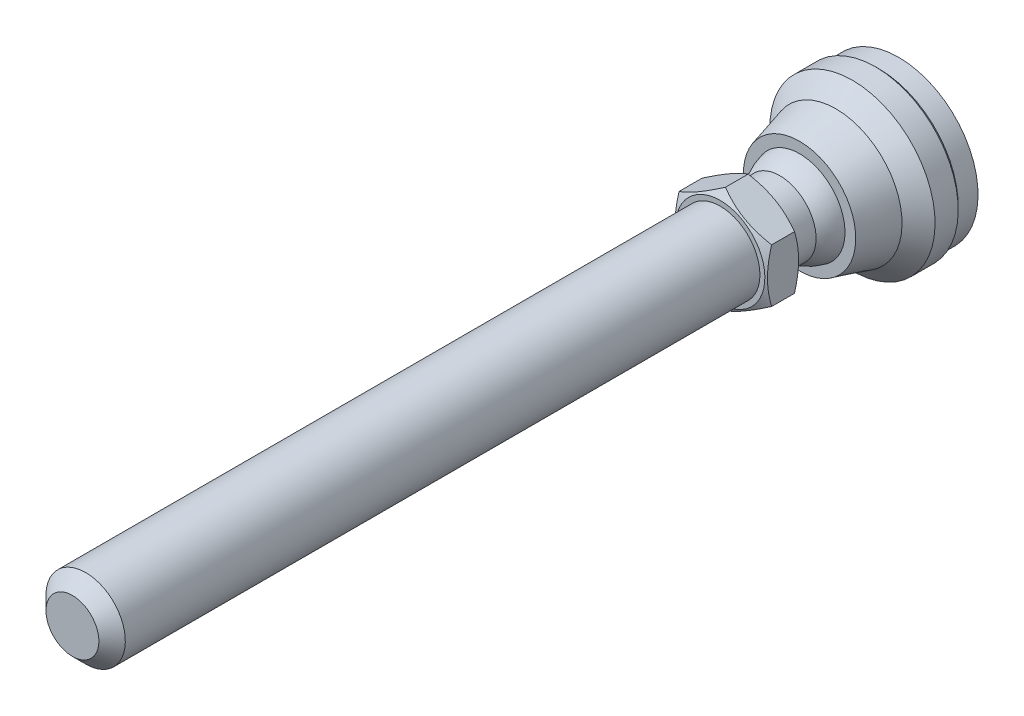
ISO-10303-21;
HEADER;
FILE_DESCRIPTION(('STEP AP214'),'2;1');
FILE_NAME('part.step','',(''),(''),'','','');
FILE_SCHEMA(('AUTOMOTIVE_DESIGN { 1 0 10303 214 1 1 1 1 }'));
ENDSEC;
DATA;
#1=APPLICATION_CONTEXT('core data for automotive mechanical design processes');
#2=APPLICATION_PROTOCOL_DEFINITION('international standard','automotive_design',2000,#1);
#3=PRODUCT_CONTEXT('',#1,'mechanical');
#4=PRODUCT('Part','Part','',(#3));
#5=PRODUCT_RELATED_PRODUCT_CATEGORY('part','',(#4));
#6=PRODUCT_DEFINITION_FORMATION('','',#4);
#7=PRODUCT_DEFINITION_CONTEXT('part definition',#1,'design');
#8=PRODUCT_DEFINITION('design','',#6,#7);
#9=PRODUCT_DEFINITION_SHAPE('','',#8);
#10=(LENGTH_UNIT() NAMED_UNIT(*) SI_UNIT(.MILLI.,.METRE.));
#11=(NAMED_UNIT(*) PLANE_ANGLE_UNIT() SI_UNIT($,.RADIAN.));
#12=(NAMED_UNIT(*) SI_UNIT($,.STERADIAN.) SOLID_ANGLE_UNIT());
#13=UNCERTAINTY_MEASURE_WITH_UNIT(LENGTH_MEASURE(1.E-05),#10,'distance_accuracy_value','');
#14=(GEOMETRIC_REPRESENTATION_CONTEXT(3) GLOBAL_UNCERTAINTY_ASSIGNED_CONTEXT((#13)) GLOBAL_UNIT_ASSIGNED_CONTEXT((#10,
#11,#12)) REPRESENTATION_CONTEXT('',''));
#15=CARTESIAN_POINT('',(0.,0.,0.));
#16=DIRECTION('',(0.,0.,1.));
#17=DIRECTION('',(1.,0.,0.));
#18=AXIS2_PLACEMENT_3D('',#15,#16,#17);
#19=CARTESIAN_POINT('',(-5.49999999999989,0.,21.9999999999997));
#20=DIRECTION('',(0.,0.,1.));
#21=DIRECTION('',(0.,-1.,0.));
#22=AXIS2_PLACEMENT_3D('',#19,#20,#21);
#23=PLANE('',#22);
#24=CARTESIAN_POINT('',(0.,0.,21.9999999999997));
#25=DIRECTION('',(0.,0.,1.));
#26=DIRECTION('',(0.,-1.,0.));
#27=AXIS2_PLACEMENT_3D('',#24,#25,#26);
#28=CIRCLE('',#27,6.75);
#29=CARTESIAN_POINT('',(0.,-6.75,21.9999999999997));
#30=VERTEX_POINT('',#29);
#31=EDGE_CURVE('E440',#30,#30,#28,.T.);
#32=ORIENTED_EDGE('',*,*,#31,.F.);
#33=EDGE_LOOP('',(#32));
#34=FACE_BOUND('',#33,.T.);
#35=CARTESIAN_POINT('',(0.,0.,21.9999999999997));
#36=DIRECTION('',(0.,0.,-1.));
#37=DIRECTION('',(0.,1.,0.));
#38=AXIS2_PLACEMENT_3D('',#35,#36,#37);
#39=CIRCLE('',#38,5.49999999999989);
#40=CARTESIAN_POINT('',(0.,5.49999999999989,21.9999999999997));
#41=VERTEX_POINT('',#40);
#42=EDGE_CURVE('E120',#41,#41,#39,.T.);
#43=ORIENTED_EDGE('',*,*,#42,.F.);
#44=EDGE_LOOP('',(#43));
#45=FACE_BOUND('',#44,.T.);
#46=ADVANCED_FACE('F14',(#34,#45),#23,.F.);
#47=CARTESIAN_POINT('',(0.,0.,0.));
#48=DIRECTION('',(0.,0.,-1.));
#49=DIRECTION('',(0.,1.,0.));
#50=AXIS2_PLACEMENT_3D('',#47,#48,#49);
#51=CYLINDRICAL_SURFACE('',#50,5.49999999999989);
#52=CARTESIAN_POINT('',(0.,0.,18.));
#53=DIRECTION('',(0.,0.,-1.));
#54=DIRECTION('',(0.,1.,0.));
#55=AXIS2_PLACEMENT_3D('',#52,#53,#54);
#56=CIRCLE('',#55,5.49999999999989);
#57=CARTESIAN_POINT('',(-5.49999999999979,0.,18.));
#58=VERTEX_POINT('',#57);
#59=EDGE_CURVE('E117',#58,#58,#56,.T.);
#60=ORIENTED_EDGE('',*,*,#59,.F.);
#61=EDGE_LOOP('',(#60));
#62=FACE_BOUND('',#61,.T.);
#63=ORIENTED_EDGE('',*,*,#42,.T.);
#64=EDGE_LOOP('',(#63));
#65=FACE_BOUND('',#64,.T.);
#66=ADVANCED_FACE('F144',(#62,#65),#51,.T.);
#67=CARTESIAN_POINT('',(1.11022302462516E-13,0.,13.6698729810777));
#68=DIRECTION('',(0.,0.,-1.));
#69=DIRECTION('',(-1.,0.,0.));
#70=AXIS2_PLACEMENT_3D('',#67,#68,#69);
#71=SPHERICAL_SURFACE('',#70,7.);
#72=CARTESIAN_POINT('',(0.,0.,15.));
#73=DIRECTION('',(0.,0.,-1.));
#74=DIRECTION('',(0.,1.,0.));
#75=AXIS2_PLACEMENT_3D('',#72,#73,#74);
#76=CIRCLE('',#75,6.87246404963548);
#77=CARTESIAN_POINT('',(-6.87246404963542,0.,15.));
#78=VERTEX_POINT('',#77);
#79=EDGE_CURVE('E114',#78,#78,#76,.T.);
#80=CARTESIAN_POINT('',(-6.87246404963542,0.,15.));
#81=CARTESIAN_POINT('',(-6.86587210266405,0.,15.0340591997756));
#82=CARTESIAN_POINT('',(-6.8590269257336,0.,15.0680693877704));
#83=CARTESIAN_POINT('',(-6.84483171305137,0.,15.1359842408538));
#84=CARTESIAN_POINT('',(-6.83748167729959,0.,15.1698889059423));
#85=CARTESIAN_POINT('',(-6.8222783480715,0.,15.2375852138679));
#86=CARTESIAN_POINT('',(-6.81442505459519,0.,15.2713768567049));
#87=CARTESIAN_POINT('',(-6.79821695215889,0.,15.3388396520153));
#88=CARTESIAN_POINT('',(-6.78986214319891,0.,15.3725108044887));
#89=CARTESIAN_POINT('',(-6.77265285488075,0.,15.4397251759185));
#90=CARTESIAN_POINT('',(-6.76379837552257,0.,15.473268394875));
#91=CARTESIAN_POINT('',(-6.74559170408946,0.,15.5402194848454));
#92=CARTESIAN_POINT('',(-6.73623951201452,0.,15.5736273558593));
#93=CARTESIAN_POINT('',(-6.71703948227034,0.,15.6403003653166));
#94=CARTESIAN_POINT('',(-6.7071916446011,0.,15.67356550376));
#95=CARTESIAN_POINT('',(-6.68700250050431,0.,15.7399456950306));
#96=CARTESIAN_POINT('',(-6.67666119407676,0.,15.7730607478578));
#97=CARTESIAN_POINT('',(-6.65548739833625,0.,15.8391334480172));
#98=CARTESIAN_POINT('',(-6.64465490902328,0.,15.8720910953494));
#99=CARTESIAN_POINT('',(-6.62250114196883,0.,15.9378416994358));
#100=CARTESIAN_POINT('',(-6.61117986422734,0.,15.9706346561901));
#101=CARTESIAN_POINT('',(-6.58805102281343,0.,16.0360486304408));
#102=CARTESIAN_POINT('',(-6.57624345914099,0.,16.0686696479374));
#103=CARTESIAN_POINT('',(-6.55214465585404,0.,16.1337325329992));
#104=CARTESIAN_POINT('',(-6.53985341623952,0.,16.1661744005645));
#105=CARTESIAN_POINT('',(-6.51478997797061,0.,16.2308718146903));
#106=CARTESIAN_POINT('',(-6.50201777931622,0.,16.2631273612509));
#107=CARTESIAN_POINT('',(-6.47599524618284,0.,16.3274450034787));
#108=CARTESIAN_POINT('',(-6.46274491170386,0.,16.3595070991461));
#109=CARTESIAN_POINT('',(-6.43576903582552,0.,16.4234307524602));
#110=CARTESIAN_POINT('',(-6.42204349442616,0.,16.455292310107));
#111=CARTESIAN_POINT('',(-6.39412023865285,0.,16.5188078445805));
#112=CARTESIAN_POINT('',(-6.37992252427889,0.,16.5504618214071));
#113=CARTESIAN_POINT('',(-6.35105806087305,0.,16.6135551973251));
#114=CARTESIAN_POINT('',(-6.33639131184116,0.,16.6449945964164));
#115=CARTESIAN_POINT('',(-6.30659202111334,0.,16.7076518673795));
#116=CARTESIAN_POINT('',(-6.2914594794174,0.,16.7388697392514));
#117=CARTESIAN_POINT('',(-6.26073194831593,0.,16.8010770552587));
#118=CARTESIAN_POINT('',(-6.24513695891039,0.,16.8320664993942));
#119=CARTESIAN_POINT('',(-6.21348797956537,0.,16.8938101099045));
#120=CARTESIAN_POINT('',(-6.19743398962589,0.,16.9245642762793));
#121=CARTESIAN_POINT('',(-6.16487055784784,0.,16.9858305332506));
#122=CARTESIAN_POINT('',(-6.14836111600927,0.,17.016342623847));
#123=CARTESIAN_POINT('',(-6.11489042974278,0.,17.0771179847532));
#124=CARTESIAN_POINT('',(-6.09792918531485,0.,17.107381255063));
#125=CARTESIAN_POINT('',(-6.06355864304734,0.,17.1676522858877));
#126=CARTESIAN_POINT('',(-6.04614934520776,0.,17.1976600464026));
#127=CARTESIAN_POINT('',(-6.01088654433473,0.,17.2574134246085));
#128=CARTESIAN_POINT('',(-5.99303304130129,0.,17.2871590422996));
#129=CARTESIAN_POINT('',(-5.9568857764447,0.,17.3463815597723));
#130=CARTESIAN_POINT('',(-5.93859201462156,0.,17.3758584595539));
#131=CARTESIAN_POINT('',(-5.90156827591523,0.,17.4345370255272));
#132=CARTESIAN_POINT('',(-5.88283829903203,0.,17.4637386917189));
#133=CARTESIAN_POINT('',(-5.84494627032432,0.,17.5218603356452));
#134=CARTESIAN_POINT('',(-5.8257842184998,0.,17.5507803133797));
#135=CARTESIAN_POINT('',(-5.78703227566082,0.,17.6083321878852));
#136=CARTESIAN_POINT('',(-5.76744238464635,0.,17.6369640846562));
#137=CARTESIAN_POINT('',(-5.72783909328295,0.,17.6939334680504));
#138=CARTESIAN_POINT('',(-5.70782569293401,0.,17.7222709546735));
#139=CARTESIAN_POINT('',(-5.66737980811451,0.,17.778645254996));
#140=CARTESIAN_POINT('',(-5.64694732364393,0.,17.8066820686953));
#141=CARTESIAN_POINT('',(-5.60566778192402,0.,17.862448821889));
#142=CARTESIAN_POINT('',(-5.58482072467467,0.,17.8901787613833));
#143=CARTESIAN_POINT('',(-5.54271666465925,0.,17.9453256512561));
#144=CARTESIAN_POINT('',(-5.52145966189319,0.,17.9727426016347));
#145=CARTESIAN_POINT('',(-5.49999999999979,0.,18.));
#146=B_SPLINE_CURVE_WITH_KNOTS('',3,(#80,#81,#82,#83,#84,#85,#86,#87,#88,#89,#90,#91,#92,#93,
#94,#95,#96,#97,#98,#99,#100,#101,#102,#103,#104,#105,#106,#107,#108,#109,#110,#111,#112,#113,
#114,#115,#116,#117,#118,#119,#120,#121,#122,#123,#124,#125,#126,#127,#128,#129,#130,#131,#132,
#133,#134,#135,#136,#137,#138,#139,#140,#141,#142,#143,#144,#145),.UNSPECIFIED.,.F.,.F.,(4,2,2,
2,2,2,2,2,2,2,2,2,2,2,2,2,2,2,2,2,2,2,2,2,2,2,2,2,2,2,2,2,4),(0.,0.104072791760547,
0.208145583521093,0.31221837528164,0.416291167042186,0.520363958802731,0.624436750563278,
0.728509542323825,0.832582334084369,0.936655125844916,1.04072791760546,1.14480070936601,
1.24887350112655,1.3529462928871,1.45701908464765,1.56109187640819,1.66516466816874,
1.76923745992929,1.87331025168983,1.97738304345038,2.08145583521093,2.18552862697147,
2.28960141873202,2.39367421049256,2.49774700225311,2.60181979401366,2.7058925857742,
2.80996537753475,2.9140381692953,3.01811096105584,3.12218375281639,3.22625654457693,
3.33032933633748),.UNSPECIFIED.);
#147=EDGE_CURVE('BSEAM151',#78,#58,#146,.T.);
#148=ORIENTED_EDGE('',*,*,#79,.F.);
#149=ORIENTED_EDGE('',*,*,#59,.T.);
#150=ORIENTED_EDGE('',*,*,#147,.T.);
#151=ORIENTED_EDGE('',*,*,#147,.F.);
#152=EDGE_LOOP('',(#148,#150,#149,#151));
#153=FACE_BOUND('',#152,.T.);
#154=ADVANCED_FACE('F151',(#153),#71,.T.);
#155=CARTESIAN_POINT('',(-8.5,0.,15.));
#156=DIRECTION('',(0.,0.,-1.));
#157=DIRECTION('',(0.,1.,0.));
#158=AXIS2_PLACEMENT_3D('',#155,#156,#157);
#159=PLANE('',#158);
#160=CARTESIAN_POINT('',(0.,0.,15.));
#161=DIRECTION('',(0.,0.,-1.));
#162=DIRECTION('',(0.,1.,0.));
#163=AXIS2_PLACEMENT_3D('',#160,#161,#162);
#164=CIRCLE('',#163,8.5);
#165=CARTESIAN_POINT('',(0.,8.5,15.));
#166=VERTEX_POINT('',#165);
#167=EDGE_CURVE('E111',#166,#166,#164,.T.);
#168=ORIENTED_EDGE('',*,*,#167,.F.);
#169=EDGE_LOOP('',(#168));
#170=FACE_BOUND('',#169,.T.);
#171=ORIENTED_EDGE('',*,*,#79,.T.);
#172=EDGE_LOOP('',(#171));
#173=FACE_BOUND('',#172,.T.);
#174=ADVANCED_FACE('F303',(#170,#173),#159,.F.);
#175=CARTESIAN_POINT('',(0.,0.,15.));
#176=DIRECTION('',(0.,0.,-1.));
#177=DIRECTION('',(0.,1.,0.));
#178=AXIS2_PLACEMENT_3D('',#175,#176,#177);
#179=CONICAL_SURFACE('',#178,8.5,0.266252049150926);
#180=CARTESIAN_POINT('',(0.,0.,9.4999999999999));
#181=DIRECTION('',(0.,0.,-1.));
#182=DIRECTION('',(0.,1.,0.));
#183=AXIS2_PLACEMENT_3D('',#180,#181,#182);
#184=CIRCLE('',#183,10.);
#185=CARTESIAN_POINT('',(0.,10.,9.4999999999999));
#186=VERTEX_POINT('',#185);
#187=EDGE_CURVE('E108',#186,#186,#184,.T.);
#188=ORIENTED_EDGE('',*,*,#187,.F.);
#189=EDGE_LOOP('',(#188));
#190=FACE_BOUND('',#189,.T.);
#191=ORIENTED_EDGE('',*,*,#167,.T.);
#192=EDGE_LOOP('',(#191));
#193=FACE_BOUND('',#192,.T.);
#194=ADVANCED_FACE('F293',(#190,#193),#179,.T.);
#195=CARTESIAN_POINT('',(0.,0.,9.4999999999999));
#196=DIRECTION('',(0.,0.,-1.));
#197=DIRECTION('',(0.,1.,0.));
#198=AXIS2_PLACEMENT_3D('',#195,#196,#197);
#199=CONICAL_SURFACE('',#198,10.,0.785398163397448);
#200=CARTESIAN_POINT('',(0.,0.,6.9999999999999));
#201=DIRECTION('',(0.,0.,-1.));
#202=DIRECTION('',(0.,1.,0.));
#203=AXIS2_PLACEMENT_3D('',#200,#201,#202);
#204=CIRCLE('',#203,12.5);
#205=CARTESIAN_POINT('',(0.,12.5,6.9999999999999));
#206=VERTEX_POINT('',#205);
#207=EDGE_CURVE('E105',#206,#206,#204,.T.);
#208=ORIENTED_EDGE('',*,*,#207,.F.);
#209=EDGE_LOOP('',(#208));
#210=FACE_BOUND('',#209,.T.);
#211=ORIENTED_EDGE('',*,*,#187,.T.);
#212=EDGE_LOOP('',(#211));
#213=FACE_BOUND('',#212,.T.);
#214=ADVANCED_FACE('F283',(#210,#213),#199,.T.);
#215=CARTESIAN_POINT('',(0.,0.,0.));
#216=DIRECTION('',(0.,0.,-1.));
#217=DIRECTION('',(0.,1.,0.));
#218=AXIS2_PLACEMENT_3D('',#215,#216,#217);
#219=CYLINDRICAL_SURFACE('',#218,12.5);
#220=CARTESIAN_POINT('',(0.,0.,3.49999999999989));
#221=DIRECTION('',(0.,0.,-1.));
#222=DIRECTION('',(0.,1.,0.));
#223=AXIS2_PLACEMENT_3D('',#220,#221,#222);
#224=CIRCLE('',#223,12.5);
#225=CARTESIAN_POINT('',(0.,12.5,3.49999999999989));
#226=VERTEX_POINT('',#225);
#227=EDGE_CURVE('E102',#226,#226,#224,.T.);
#228=ORIENTED_EDGE('',*,*,#227,.F.);
#229=EDGE_LOOP('',(#228));
#230=FACE_BOUND('',#229,.T.);
#231=ORIENTED_EDGE('',*,*,#207,.T.);
#232=EDGE_LOOP('',(#231));
#233=FACE_BOUND('',#232,.T.);
#234=ADVANCED_FACE('F273',(#230,#233),#219,.T.);
#235=CARTESIAN_POINT('',(0.,0.,3.49999999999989));
#236=DIRECTION('',(0.,0.,1.));
#237=DIRECTION('',(0.,-1.,0.));
#238=AXIS2_PLACEMENT_3D('',#235,#236,#237);
#239=CONICAL_SURFACE('',#238,12.5,0.785398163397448);
#240=CARTESIAN_POINT('',(0.,0.,2.99999999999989));
#241=DIRECTION('',(0.,0.,-1.));
#242=DIRECTION('',(0.,1.,0.));
#243=AXIS2_PLACEMENT_3D('',#240,#241,#242);
#244=CIRCLE('',#243,12.);
#245=CARTESIAN_POINT('',(0.,12.,2.99999999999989));
#246=VERTEX_POINT('',#245);
#247=EDGE_CURVE('E99',#246,#246,#244,.T.);
#248=ORIENTED_EDGE('',*,*,#247,.F.);
#249=EDGE_LOOP('',(#248));
#250=FACE_BOUND('',#249,.T.);
#251=ORIENTED_EDGE('',*,*,#227,.T.);
#252=EDGE_LOOP('',(#251));
#253=FACE_BOUND('',#252,.T.);
#254=ADVANCED_FACE('F263',(#250,#253),#239,.T.);
#255=CARTESIAN_POINT('',(0.,0.,0.));
#256=DIRECTION('',(0.,0.,-1.));
#257=DIRECTION('',(0.,1.,0.));
#258=AXIS2_PLACEMENT_3D('',#255,#256,#257);
#259=CYLINDRICAL_SURFACE('',#258,12.);
#260=CARTESIAN_POINT('',(0.,0.,0.));
#261=DIRECTION('',(0.,0.,-1.));
#262=DIRECTION('',(0.,1.,0.));
#263=AXIS2_PLACEMENT_3D('',#260,#261,#262);
#264=CIRCLE('',#263,12.);
#265=CARTESIAN_POINT('',(0.,12.,0.));
#266=VERTEX_POINT('',#265);
#267=EDGE_CURVE('E96',#266,#266,#264,.T.);
#268=ORIENTED_EDGE('',*,*,#267,.F.);
#269=EDGE_LOOP('',(#268));
#270=FACE_BOUND('',#269,.T.);
#271=ORIENTED_EDGE('',*,*,#247,.T.);
#272=EDGE_LOOP('',(#271));
#273=FACE_BOUND('',#272,.T.);
#274=ADVANCED_FACE('F252',(#270,#273),#259,.T.);
#275=CARTESIAN_POINT('',(-12.,0.,0.));
#276=DIRECTION('',(0.,0.,1.));
#277=DIRECTION('',(0.,-1.,0.));
#278=AXIS2_PLACEMENT_3D('',#275,#276,#277);
#279=PLANE('',#278);
#280=ORIENTED_EDGE('',*,*,#267,.T.);
#281=EDGE_LOOP('',(#280));
#282=FACE_BOUND('',#281,.T.);
#283=ADVANCED_FACE('F142',(#282),#279,.F.);
#284=CARTESIAN_POINT('',(0.,0.,21.9999999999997));
#285=DIRECTION('',(0.,0.,1.));
#286=DIRECTION('',(0.,-1.,0.));
#287=AXIS2_PLACEMENT_3D('',#284,#285,#286);
#288=CONICAL_SURFACE('',#287,6.75,1.0471975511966);
#289=CARTESIAN_POINT('',(0.000200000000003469,-8.0830192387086,22.7696190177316));
#290=CARTESIAN_POINT('',(-0.153667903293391,-7.99418356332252,22.7183374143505));
#291=CARTESIAN_POINT('',(-0.30810950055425,-7.90501666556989,22.6693831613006));
#292=CARTESIAN_POINT('',(-0.618246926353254,-7.72595873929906,22.5767703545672));
#293=CARTESIAN_POINT('',(-0.773943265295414,-7.63606741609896,22.5331140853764));
#294=CARTESIAN_POINT('',(-1.24352516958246,-7.36495417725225,22.4109491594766));
#295=CARTESIAN_POINT('',(-1.5592643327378,-7.18266208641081,22.341463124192));
#296=CARTESIAN_POINT('',(-2.03176224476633,-6.90986528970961,22.2599825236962));
#297=CARTESIAN_POINT('',(-2.18710922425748,-6.82017566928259,22.2367710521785));
#298=CARTESIAN_POINT('',(-2.49850511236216,-6.64039116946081,22.1978487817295));
#299=CARTESIAN_POINT('',(-2.65455395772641,-6.55029632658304,22.1821373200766));
#300=CARTESIAN_POINT('',(-2.96692267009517,-6.36995016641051,22.1586154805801));
#301=CARTESIAN_POINT('',(-3.12324202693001,-6.27969914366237,22.1507961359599));
#302=CARTESIAN_POINT('',(-3.43601650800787,-6.09911871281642,22.1432178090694));
#303=CARTESIAN_POINT('',(-3.59247162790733,-6.00878930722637,22.143458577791));
#304=CARTESIAN_POINT('',(-4.02110687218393,-5.76131663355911,22.1551972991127));
#305=CARTESIAN_POINT('',(-4.2931466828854,-5.60425437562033,22.17490331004));
#306=CARTESIAN_POINT('',(-4.83541944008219,-5.29117305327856,22.2373910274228));
#307=CARTESIAN_POINT('',(-5.10565047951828,-5.13515508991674,22.28019409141));
#308=CARTESIAN_POINT('',(-5.64901454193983,-4.82144370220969,22.3871892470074));
#309=CARTESIAN_POINT('',(-5.92207900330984,-4.6637898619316,22.4518346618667));
#310=CARTESIAN_POINT('',(-6.46413578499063,-4.35083323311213,22.5985536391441));
#311=CARTESIAN_POINT('',(-6.73313504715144,-4.19552643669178,22.6805927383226));
#312=CARTESIAN_POINT('',(-7.0002,-4.04133641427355,22.7696190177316));
#313=B_SPLINE_CURVE_WITH_KNOTS('',3,(#289,#290,#291,#292,#293,#294,#295,#296,#297,#298,#299,
#300,#301,#302,#303,#304,#305,#306,#307,#308,#309,#310,#311,#312),.UNSPECIFIED.,.F.,.F.,(4,2,2,
2,2,2,2,2,2,2,2,4),(0.,0.554727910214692,1.10969417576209,2.2219327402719,2.76443041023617,
3.30688013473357,3.8487128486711,4.39052882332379,5.33376515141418,6.27787517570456,
7.24292418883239,8.20607866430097),.UNSPECIFIED.);
#314=CARTESIAN_POINT('',(0.,-8.08290376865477,22.7695523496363));
#315=VERTEX_POINT('',#314);
#316=CARTESIAN_POINT('',(-7.,-4.04145188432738,22.7695523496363));
#317=VERTEX_POINT('',#316);
#318=EDGE_CURVE('E73',#315,#317,#313,.T.);
#319=ORIENTED_EDGE('',*,*,#318,.T.);
#320=CARTESIAN_POINT('',(-7.,10.8160964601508,25.5412533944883));
#321=CARTESIAN_POINT('',(-7.,10.5106902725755,25.3932642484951));
#322=CARTESIAN_POINT('',(-7.,10.2045787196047,25.2467056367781));
#323=CARTESIAN_POINT('',(-7.,9.59056960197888,24.9572548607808));
#324=CARTESIAN_POINT('',(-7.,9.28267176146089,24.814363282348));
#325=CARTESIAN_POINT('',(-7.,8.66310926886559,24.5323245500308));
#326=CARTESIAN_POINT('',(-7.,8.35143320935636,24.3932023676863));
#327=CARTESIAN_POINT('',(-7.,7.72558820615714,24.1207047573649));
#328=CARTESIAN_POINT('',(-7.,7.41141938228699,23.9873290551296));
#329=CARTESIAN_POINT('',(-7.,6.77010502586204,23.723739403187));
#330=CARTESIAN_POINT('',(-7.,6.44286314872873,23.5937585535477));
#331=CARTESIAN_POINT('',(-7.,5.78453703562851,23.3437308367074));
#332=CARTESIAN_POINT('',(-7.,5.45345237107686,23.2236850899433));
#333=CARTESIAN_POINT('',(-7.,4.78754258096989,22.9967085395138));
#334=CARTESIAN_POINT('',(-7.,4.45272672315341,22.8897508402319));
#335=CARTESIAN_POINT('',(-7.,3.77830473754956,22.6924071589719));
#336=CARTESIAN_POINT('',(-7.,3.43870016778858,22.6020159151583));
#337=CARTESIAN_POINT('',(-7.,2.75632718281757,22.4426535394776));
#338=CARTESIAN_POINT('',(-7.,2.41358627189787,22.373567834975));
#339=CARTESIAN_POINT('',(-7.,1.89638584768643,22.2889294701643));
#340=CARTESIAN_POINT('',(-7.,1.7234578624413,22.2638805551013));
#341=CARTESIAN_POINT('',(-7.,1.37675593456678,22.2206049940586));
#342=CARTESIAN_POINT('',(-7.,1.20298207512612,22.2023776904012));
#343=CARTESIAN_POINT('',(-7.,0.857073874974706,22.1733350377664));
#344=CARTESIAN_POINT('',(-7.,0.684947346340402,22.162427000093));
#345=CARTESIAN_POINT('',(-7.,0.34038743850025,22.1478968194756));
#346=CARTESIAN_POINT('',(-7.,0.16795406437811,22.144274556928));
#347=CARTESIAN_POINT('',(-7.,-0.176911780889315,22.1444022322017));
#348=CARTESIAN_POINT('',(-7.,-0.349344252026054,22.148152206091));
#349=CARTESIAN_POINT('',(-7.,-0.693899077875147,22.162933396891));
#350=CARTESIAN_POINT('',(-7.,-0.86602141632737,22.1739649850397));
#351=CARTESIAN_POINT('',(-7.,-1.2808954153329,22.2090986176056));
#352=CARTESIAN_POINT('',(-7.,-1.5233549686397,22.2367227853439));
#353=CARTESIAN_POINT('',(-7.,-2.00643692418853,22.3049034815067));
#354=CARTESIAN_POINT('',(-7.,-2.24705906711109,22.3454618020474));
#355=CARTESIAN_POINT('',(-7.,-2.9659153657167,22.4843841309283));
#356=CARTESIAN_POINT('',(-7.,-3.44086342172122,22.5999690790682));
#357=CARTESIAN_POINT('',(-7.,-4.15098674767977,22.7999309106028));
#358=CARTESIAN_POINT('',(-7.,-4.38985722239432,22.8719357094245));
#359=CARTESIAN_POINT('',(-7.,-4.86527727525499,23.0233061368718));
#360=CARTESIAN_POINT('',(-7.,-5.10182683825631,23.1026718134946));
#361=CARTESIAN_POINT('',(-7.,-5.57268177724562,23.2675004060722));
#362=CARTESIAN_POINT('',(-7.,-5.80698789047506,23.3529612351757));
#363=CARTESIAN_POINT('',(-7.,-6.27366676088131,23.5289863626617));
#364=CARTESIAN_POINT('',(-7.,-6.50603953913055,23.6195506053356));
#365=CARTESIAN_POINT('',(-7.,-7.04797533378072,23.8365252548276));
#366=CARTESIAN_POINT('',(-7.,-7.35685712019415,23.9646338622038));
#367=CARTESIAN_POINT('',(-7.,-7.97205012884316,24.2268984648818));
#368=CARTESIAN_POINT('',(-7.,-8.27836120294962,24.3610548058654));
#369=CARTESIAN_POINT('',(-7.,-8.88887718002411,24.6342184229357));
#370=CARTESIAN_POINT('',(-7.,-9.19308166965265,24.7732266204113));
#371=CARTESIAN_POINT('',(-7.,-9.79968372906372,25.0551379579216));
#372=CARTESIAN_POINT('',(-7.,-10.1020812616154,25.1980411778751));
#373=CARTESIAN_POINT('',(-7.,-10.7056642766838,25.4871670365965));
#374=CARTESIAN_POINT('',(-7.,-11.0068481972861,25.6333929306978));
#375=CARTESIAN_POINT('',(-7.,-11.6079306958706,25.9284654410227));
#376=CARTESIAN_POINT('',(-7.,-11.9078292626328,26.0773120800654));
#377=CARTESIAN_POINT('',(-7.,-12.8058242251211,26.5270575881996));
#378=CARTESIAN_POINT('',(-7.,-13.4022964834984,26.8311990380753));
#379=CARTESIAN_POINT('',(-7.,-14.5432540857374,27.4203775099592));
#380=CARTESIAN_POINT('',(-7.,-15.0879886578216,27.7049340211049));
#381=CARTESIAN_POINT('',(-7.,-16.1754286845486,28.2779391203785));
#382=CARTESIAN_POINT('',(-7.,-16.7181340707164,28.5663878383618));
#383=CARTESIAN_POINT('',(-7.,-17.80065538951,29.1455595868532));
#384=CARTESIAN_POINT('',(-7.,-18.3404751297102,29.4362755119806));
#385=CARTESIAN_POINT('',(-7.,-19.4188134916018,30.0200433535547));
#386=CARTESIAN_POINT('',(-7.,-19.9573321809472,30.3130951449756));
#387=CARTESIAN_POINT('',(-7.,-20.4953701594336,30.6070209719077));
#388=B_SPLINE_CURVE_WITH_KNOTS('',3,(#320,#321,#322,#323,#324,#325,#326,#327,#328,#329,#330,
#331,#332,#333,#334,#335,#336,#337,#338,#339,#340,#341,#342,#343,#344,#345,#346,#347,#348,#349,
#350,#351,#352,#353,#354,#355,#356,#357,#358,#359,#360,#361,#362,#363,#364,#365,#366,#367,#368,
#369,#370,#371,#372,#373,#374,#375,#376,#377,#378,#379,#380,#381,#382,#383,#384,#385,#386,#387),
.UNSPECIFIED.,.F.,.F.,(4,2,2,2,2,2,2,2,2,2,2,2,2,2,2,2,2,2,2,2,2,2,2,2,2,2,2,2,2,2,2,2,2,4),(0.,
1.01813027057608,2.03642219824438,3.06032521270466,4.0841793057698,5.14038763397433,
6.19671491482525,7.25083365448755,8.30461700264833,9.35263052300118,9.87671539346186,
10.4007497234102,10.9180158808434,11.4352735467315,11.9525337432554,12.4698203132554,
13.2014904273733,13.933261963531,15.3976330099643,16.1460332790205,16.8944384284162,
17.6425885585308,18.3907305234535,19.3938283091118,20.3969835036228,21.4003302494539,
22.4036975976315,23.4080944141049,24.4124999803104,26.4210559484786,28.2647781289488,
30.1085619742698,31.9479280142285,33.7871962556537),.UNSPECIFIED.);
#389=CARTESIAN_POINT('',(-7.,4.04145188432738,22.7695523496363));
#390=VERTEX_POINT('',#389);
#391=EDGE_CURVE('E81',#317,#390,#388,.F.);
#392=ORIENTED_EDGE('',*,*,#391,.T.);
#393=CARTESIAN_POINT('',(-7.0002,4.04133641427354,22.7696190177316));
#394=CARTESIAN_POINT('',(-6.84633209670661,4.13017208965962,22.7183374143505));
#395=CARTESIAN_POINT('',(-6.69189049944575,4.21933898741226,22.6693831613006));
#396=CARTESIAN_POINT('',(-6.38175307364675,4.39839691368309,22.5767703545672));
#397=CARTESIAN_POINT('',(-6.22605673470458,4.48828823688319,22.5331140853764));
#398=CARTESIAN_POINT('',(-5.75647483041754,4.75940147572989,22.4109491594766));
#399=CARTESIAN_POINT('',(-5.4407356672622,4.94169356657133,22.341463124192));
#400=CARTESIAN_POINT('',(-4.96823775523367,5.21449036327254,22.2599825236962));
#401=CARTESIAN_POINT('',(-4.81289077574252,5.30417998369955,22.2367710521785));
#402=CARTESIAN_POINT('',(-4.50149488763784,5.48396448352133,22.1978487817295));
#403=CARTESIAN_POINT('',(-4.34544604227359,5.57405932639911,22.1821373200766));
#404=CARTESIAN_POINT('',(-4.03307732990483,5.75440548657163,22.1586154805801));
#405=CARTESIAN_POINT('',(-3.87675797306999,5.84465650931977,22.1507961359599));
#406=CARTESIAN_POINT('',(-3.56398349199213,6.02523694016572,22.1432178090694));
#407=CARTESIAN_POINT('',(-3.40752837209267,6.11556634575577,22.143458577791));
#408=CARTESIAN_POINT('',(-2.97889312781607,6.36303901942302,22.1551972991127));
#409=CARTESIAN_POINT('',(-2.7068533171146,6.52010127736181,22.17490331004));
#410=CARTESIAN_POINT('',(-2.16458055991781,6.83318259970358,22.2373910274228));
#411=CARTESIAN_POINT('',(-1.89434952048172,6.9892005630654,22.28019409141));
#412=CARTESIAN_POINT('',(-1.35098545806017,7.30291195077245,22.3871892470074));
#413=CARTESIAN_POINT('',(-1.07792099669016,7.46056579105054,22.4518346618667));
#414=CARTESIAN_POINT('',(-0.535864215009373,7.77352241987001,22.5985536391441));
#415=CARTESIAN_POINT('',(-0.266864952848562,7.92882921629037,22.6805927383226));
#416=CARTESIAN_POINT('',(0.000199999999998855,8.0830192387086,22.7696190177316));
#417=B_SPLINE_CURVE_WITH_KNOTS('',3,(#393,#394,#395,#396,#397,#398,#399,#400,#401,#402,#403,
#404,#405,#406,#407,#408,#409,#410,#411,#412,#413,#414,#415,#416),.UNSPECIFIED.,.F.,.F.,(4,2,2,
2,2,2,2,2,2,2,2,4),(0.,0.554727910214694,1.10969417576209,2.2219327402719,2.76443041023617,
3.30688013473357,3.84871284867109,4.39052882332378,5.33376515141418,6.27787517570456,
7.2429241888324,8.20607866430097),.UNSPECIFIED.);
#418=CARTESIAN_POINT('',(0.,8.08290376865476,22.7695523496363));
#419=VERTEX_POINT('',#418);
#420=EDGE_CURVE('E395',#390,#419,#417,.T.);
#421=ORIENTED_EDGE('',*,*,#420,.T.);
#422=CARTESIAN_POINT('',(-0.000200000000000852,8.0830192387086,22.7696190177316));
#423=CARTESIAN_POINT('',(0.153667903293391,7.99418356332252,22.7183374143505));
#424=CARTESIAN_POINT('',(0.308109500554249,7.90501666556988,22.6693831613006));
#425=CARTESIAN_POINT('',(0.618246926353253,7.72595873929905,22.5767703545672));
#426=CARTESIAN_POINT('',(0.773943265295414,7.63606741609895,22.5331140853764));
#427=CARTESIAN_POINT('',(1.24352516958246,7.36495417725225,22.4109491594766));
#428=CARTESIAN_POINT('',(1.5592643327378,7.18266208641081,22.341463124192));
#429=CARTESIAN_POINT('',(2.03176224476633,6.9098652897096,22.2599825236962));
#430=CARTESIAN_POINT('',(2.18710922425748,6.82017566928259,22.2367710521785));
#431=CARTESIAN_POINT('',(2.49850511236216,6.64039116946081,22.1978487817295));
#432=CARTESIAN_POINT('',(2.6545539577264,6.55029632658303,22.1821373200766));
#433=CARTESIAN_POINT('',(2.96692267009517,6.36995016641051,22.1586154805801));
#434=CARTESIAN_POINT('',(3.12324202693,6.27969914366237,22.1507961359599));
#435=CARTESIAN_POINT('',(3.43601650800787,6.09911871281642,22.1432178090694));
#436=CARTESIAN_POINT('',(3.59247162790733,6.00878930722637,22.143458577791));
#437=CARTESIAN_POINT('',(4.02110687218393,5.76131663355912,22.1551972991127));
#438=CARTESIAN_POINT('',(4.29314668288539,5.60425437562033,22.17490331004));
#439=CARTESIAN_POINT('',(4.83541944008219,5.29117305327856,22.2373910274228));
#440=CARTESIAN_POINT('',(5.10565047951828,5.13515508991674,22.28019409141));
#441=CARTESIAN_POINT('',(5.64901454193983,4.82144370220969,22.3871892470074));
#442=CARTESIAN_POINT('',(5.92207900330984,4.66378986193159,22.4518346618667));
#443=CARTESIAN_POINT('',(6.46413578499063,4.35083323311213,22.5985536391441));
#444=CARTESIAN_POINT('',(6.73313504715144,4.19552643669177,22.6805927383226));
#445=CARTESIAN_POINT('',(7.0002,4.04133641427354,22.7696190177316));
#446=B_SPLINE_CURVE_WITH_KNOTS('',3,(#422,#423,#424,#425,#426,#427,#428,#429,#430,#431,#432,
#433,#434,#435,#436,#437,#438,#439,#440,#441,#442,#443,#444,#445),.UNSPECIFIED.,.F.,.F.,(4,2,2,
2,2,2,2,2,2,2,2,4),(0.,0.554727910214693,1.10969417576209,2.22193274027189,2.76443041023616,
3.30688013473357,3.84871284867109,4.39052882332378,5.33376515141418,6.27787517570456,
7.2429241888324,8.20607866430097),.UNSPECIFIED.);
#447=CARTESIAN_POINT('',(7.,4.04145188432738,22.7695523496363));
#448=VERTEX_POINT('',#447);
#449=EDGE_CURVE('E390',#419,#448,#446,.T.);
#450=ORIENTED_EDGE('',*,*,#449,.T.);
#451=CARTESIAN_POINT('',(7.,10.8160964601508,25.5412533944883));
#452=CARTESIAN_POINT('',(7.,10.5106902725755,25.3932642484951));
#453=CARTESIAN_POINT('',(7.,10.2045787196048,25.2467056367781));
#454=CARTESIAN_POINT('',(7.,9.59056960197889,24.9572548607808));
#455=CARTESIAN_POINT('',(7.,9.28267176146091,24.814363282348));
#456=CARTESIAN_POINT('',(7.,8.66310926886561,24.5323245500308));
#457=CARTESIAN_POINT('',(7.,8.35143320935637,24.3932023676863));
#458=CARTESIAN_POINT('',(7.,7.72558820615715,24.1207047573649));
#459=CARTESIAN_POINT('',(7.,7.411419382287,23.9873290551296));
#460=CARTESIAN_POINT('',(7.,6.77010502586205,23.723739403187));
#461=CARTESIAN_POINT('',(7.,6.44286314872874,23.5937585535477));
#462=CARTESIAN_POINT('',(7.,5.78453703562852,23.3437308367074));
#463=CARTESIAN_POINT('',(7.,5.45345237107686,23.2236850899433));
#464=CARTESIAN_POINT('',(7.,4.7875425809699,22.9967085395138));
#465=CARTESIAN_POINT('',(7.,4.45272672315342,22.8897508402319));
#466=CARTESIAN_POINT('',(7.,3.77830473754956,22.6924071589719));
#467=CARTESIAN_POINT('',(7.,3.43870016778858,22.6020159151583));
#468=CARTESIAN_POINT('',(7.,2.75632718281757,22.4426535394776));
#469=CARTESIAN_POINT('',(7.,2.41358627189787,22.373567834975));
#470=CARTESIAN_POINT('',(7.,1.89638584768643,22.2889294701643));
#471=CARTESIAN_POINT('',(7.,1.72345786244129,22.2638805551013));
#472=CARTESIAN_POINT('',(7.,1.37675593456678,22.2206049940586));
#473=CARTESIAN_POINT('',(7.,1.20298207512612,22.2023776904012));
#474=CARTESIAN_POINT('',(7.,0.857073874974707,22.1733350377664));
#475=CARTESIAN_POINT('',(7.,0.684947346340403,22.162427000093));
#476=CARTESIAN_POINT('',(7.,0.340387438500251,22.1478968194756));
#477=CARTESIAN_POINT('',(7.,0.167954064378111,22.144274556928));
#478=CARTESIAN_POINT('',(7.,-0.176911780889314,22.1444022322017));
#479=CARTESIAN_POINT('',(7.,-0.349344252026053,22.148152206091));
#480=CARTESIAN_POINT('',(7.,-0.693899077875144,22.162933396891));
#481=CARTESIAN_POINT('',(7.,-0.866021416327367,22.1739649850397));
#482=CARTESIAN_POINT('',(7.,-1.2808954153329,22.2090986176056));
#483=CARTESIAN_POINT('',(7.,-1.5233549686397,22.2367227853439));
#484=CARTESIAN_POINT('',(7.,-2.00643692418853,22.3049034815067));
#485=CARTESIAN_POINT('',(7.,-2.24705906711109,22.3454618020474));
#486=CARTESIAN_POINT('',(7.,-2.9659153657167,22.4843841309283));
#487=CARTESIAN_POINT('',(7.,-3.44086342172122,22.5999690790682));
#488=CARTESIAN_POINT('',(7.,-4.15098674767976,22.7999309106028));
#489=CARTESIAN_POINT('',(7.,-4.38985722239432,22.8719357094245));
#490=CARTESIAN_POINT('',(7.,-4.86527727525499,23.0233061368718));
#491=CARTESIAN_POINT('',(7.,-5.10182683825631,23.1026718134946));
#492=CARTESIAN_POINT('',(7.,-5.57268177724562,23.2675004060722));
#493=CARTESIAN_POINT('',(7.,-5.80698789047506,23.3529612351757));
#494=CARTESIAN_POINT('',(7.,-6.27366676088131,23.5289863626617));
#495=CARTESIAN_POINT('',(7.,-6.50603953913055,23.6195506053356));
#496=CARTESIAN_POINT('',(7.,-7.04797533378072,23.8365252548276));
#497=CARTESIAN_POINT('',(7.,-7.35685712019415,23.9646338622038));
#498=CARTESIAN_POINT('',(7.,-7.97205012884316,24.2268984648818));
#499=CARTESIAN_POINT('',(7.,-8.27836120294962,24.3610548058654));
#500=CARTESIAN_POINT('',(7.,-8.88887718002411,24.6342184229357));
#501=CARTESIAN_POINT('',(7.,-9.19308166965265,24.7732266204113));
#502=CARTESIAN_POINT('',(7.,-9.79968372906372,25.0551379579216));
#503=CARTESIAN_POINT('',(7.,-10.1020812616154,25.1980411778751));
#504=CARTESIAN_POINT('',(7.,-10.7056642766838,25.4871670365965));
#505=CARTESIAN_POINT('',(7.,-11.0068481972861,25.6333929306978));
#506=CARTESIAN_POINT('',(7.,-11.6079306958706,25.9284654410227));
#507=CARTESIAN_POINT('',(7.,-11.9078292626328,26.0773120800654));
#508=CARTESIAN_POINT('',(7.,-12.8058242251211,26.5270575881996));
#509=CARTESIAN_POINT('',(7.,-13.4022964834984,26.8311990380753));
#510=CARTESIAN_POINT('',(7.,-14.5432540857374,27.4203775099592));
#511=CARTESIAN_POINT('',(7.,-15.0879886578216,27.7049340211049));
#512=CARTESIAN_POINT('',(7.,-16.1754286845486,28.2779391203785));
#513=CARTESIAN_POINT('',(7.,-16.7181340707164,28.5663878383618));
#514=CARTESIAN_POINT('',(7.,-17.80065538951,29.1455595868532));
#515=CARTESIAN_POINT('',(7.,-18.3404751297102,29.4362755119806));
#516=CARTESIAN_POINT('',(7.,-19.4188134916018,30.0200433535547));
#517=CARTESIAN_POINT('',(7.,-19.9573321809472,30.3130951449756));
#518=CARTESIAN_POINT('',(7.,-20.4953701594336,30.6070209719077));
#519=B_SPLINE_CURVE_WITH_KNOTS('',3,(#451,#452,#453,#454,#455,#456,#457,#458,#459,#460,#461,
#462,#463,#464,#465,#466,#467,#468,#469,#470,#471,#472,#473,#474,#475,#476,#477,#478,#479,#480,
#481,#482,#483,#484,#485,#486,#487,#488,#489,#490,#491,#492,#493,#494,#495,#496,#497,#498,#499,
#500,#501,#502,#503,#504,#505,#506,#507,#508,#509,#510,#511,#512,#513,#514,#515,#516,#517,#518),
.UNSPECIFIED.,.F.,.F.,(4,2,2,2,2,2,2,2,2,2,2,2,2,2,2,2,2,2,2,2,2,2,2,2,2,2,2,2,2,2,2,2,2,4),(0.,
1.01813027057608,2.03642219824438,3.06032521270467,4.08417930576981,5.14038763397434,
6.19671491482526,7.25083365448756,8.30461700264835,9.3526305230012,9.87671539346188,
10.4007497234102,10.9180158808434,11.4352735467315,11.9525337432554,12.4698203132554,
13.2014904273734,13.933261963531,15.3976330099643,16.1460332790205,16.8944384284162,
17.6425885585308,18.3907305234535,19.3938283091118,20.3969835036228,21.4003302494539,
22.4036975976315,23.4080944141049,24.4124999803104,26.4210559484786,28.2647781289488,
30.1085619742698,31.9479280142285,33.7871962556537),.UNSPECIFIED.);
#520=CARTESIAN_POINT('',(7.,-4.04145188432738,22.7695523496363));
#521=VERTEX_POINT('',#520);
#522=EDGE_CURVE('E34',#448,#521,#519,.T.);
#523=ORIENTED_EDGE('',*,*,#522,.T.);
#524=CARTESIAN_POINT('',(7.0002,-4.04133641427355,22.7696190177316));
#525=CARTESIAN_POINT('',(6.84633209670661,-4.13017208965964,22.7183374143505));
#526=CARTESIAN_POINT('',(6.69189049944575,-4.21933898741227,22.6693831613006));
#527=CARTESIAN_POINT('',(6.38175307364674,-4.3983969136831,22.5767703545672));
#528=CARTESIAN_POINT('',(6.22605673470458,-4.4882882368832,22.5331140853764));
#529=CARTESIAN_POINT('',(5.75647483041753,-4.7594014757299,22.4109491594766));
#530=CARTESIAN_POINT('',(5.4407356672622,-4.94169356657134,22.341463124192));
#531=CARTESIAN_POINT('',(4.96823775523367,-5.21449036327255,22.2599825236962));
#532=CARTESIAN_POINT('',(4.81289077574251,-5.30417998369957,22.2367710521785));
#533=CARTESIAN_POINT('',(4.50149488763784,-5.48396448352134,22.1978487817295));
#534=CARTESIAN_POINT('',(4.34544604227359,-5.57405932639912,22.1821373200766));
#535=CARTESIAN_POINT('',(4.03307732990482,-5.75440548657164,22.1586154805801));
#536=CARTESIAN_POINT('',(3.87675797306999,-5.84465650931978,22.1507961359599));
#537=CARTESIAN_POINT('',(3.56398349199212,-6.02523694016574,22.1432178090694));
#538=CARTESIAN_POINT('',(3.40752837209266,-6.11556634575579,22.143458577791));
#539=CARTESIAN_POINT('',(2.97889312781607,-6.36303901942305,22.1551972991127));
#540=CARTESIAN_POINT('',(2.7068533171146,-6.52010127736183,22.17490331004));
#541=CARTESIAN_POINT('',(2.16458055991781,-6.83318259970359,22.2373910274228));
#542=CARTESIAN_POINT('',(1.89434952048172,-6.98920056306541,22.28019409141));
#543=CARTESIAN_POINT('',(1.35098545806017,-7.30291195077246,22.3871892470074));
#544=CARTESIAN_POINT('',(1.07792099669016,-7.46056579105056,22.4518346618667));
#545=CARTESIAN_POINT('',(0.535864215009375,-7.77352241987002,22.5985536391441));
#546=CARTESIAN_POINT('',(0.266864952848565,-7.92882921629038,22.6805927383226));
#547=CARTESIAN_POINT('',(-0.000199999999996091,-8.08301923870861,22.7696190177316));
#548=B_SPLINE_CURVE_WITH_KNOTS('',3,(#524,#525,#526,#527,#528,#529,#530,#531,#532,#533,#534,
#535,#536,#537,#538,#539,#540,#541,#542,#543,#544,#545,#546,#547),.UNSPECIFIED.,.F.,.F.,(4,2,2,
2,2,2,2,2,2,2,2,4),(0.,0.554727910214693,1.10969417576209,2.2219327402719,2.76443041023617,
3.30688013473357,3.8487128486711,4.39052882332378,5.33376515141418,6.27787517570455,
7.24292418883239,8.20607866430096),.UNSPECIFIED.);
#549=EDGE_CURVE('E9',#521,#315,#548,.T.);
#550=ORIENTED_EDGE('',*,*,#549,.T.);
#551=EDGE_LOOP('',(#319,#392,#421,#450,#523,#550));
#552=FACE_BOUND('',#551,.T.);
#553=ORIENTED_EDGE('',*,*,#31,.T.);
#554=EDGE_LOOP('',(#553));
#555=FACE_BOUND('',#554,.T.);
#556=ADVANCED_FACE('F71',(#552,#555),#288,.T.);
#557=CARTESIAN_POINT('',(-3.99999999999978,0.,125.));
#558=DIRECTION('',(0.,0.,-1.));
#559=DIRECTION('',(0.,1.,0.));
#560=AXIS2_PLACEMENT_3D('',#557,#558,#559);
#561=PLANE('',#560);
#562=CARTESIAN_POINT('',(0.,0.,125.));
#563=DIRECTION('',(0.,0.,-1.));
#564=DIRECTION('',(0.,1.,0.));
#565=AXIS2_PLACEMENT_3D('',#562,#563,#564);
#566=CIRCLE('',#565,3.99999999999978);
#567=CARTESIAN_POINT('',(0.,3.99999999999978,125.));
#568=VERTEX_POINT('',#567);
#569=EDGE_CURVE('E28',#568,#568,#566,.T.);
#570=ORIENTED_EDGE('',*,*,#569,.F.);
#571=EDGE_LOOP('',(#570));
#572=FACE_BOUND('',#571,.T.);
#573=ADVANCED_FACE('F16',(#572),#561,.F.);
#574=CARTESIAN_POINT('',(0.,0.,125.));
#575=DIRECTION('',(0.,0.,-1.));
#576=DIRECTION('',(0.,1.,0.));
#577=AXIS2_PLACEMENT_3D('',#574,#575,#576);
#578=CONICAL_SURFACE('',#577,3.99999999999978,0.785398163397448);
#579=CARTESIAN_POINT('',(0.,0.,123.));
#580=DIRECTION('',(0.,0.,-1.));
#581=DIRECTION('',(0.,1.,0.));
#582=AXIS2_PLACEMENT_3D('',#579,#580,#581);
#583=CIRCLE('',#582,5.99999999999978);
#584=CARTESIAN_POINT('',(0.,5.99999999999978,123.));
#585=VERTEX_POINT('',#584);
#586=EDGE_CURVE('E126',#585,#585,#583,.T.);
#587=ORIENTED_EDGE('',*,*,#586,.F.);
#588=EDGE_LOOP('',(#587));
#589=FACE_BOUND('',#588,.T.);
#590=ORIENTED_EDGE('',*,*,#569,.T.);
#591=EDGE_LOOP('',(#590));
#592=FACE_BOUND('',#591,.T.);
#593=ADVANCED_FACE('F131',(#589,#592),#578,.T.);
#594=CARTESIAN_POINT('',(0.,0.,0.));
#595=DIRECTION('',(0.,0.,-1.));
#596=DIRECTION('',(0.,1.,0.));
#597=AXIS2_PLACEMENT_3D('',#594,#595,#596);
#598=CYLINDRICAL_SURFACE('',#597,5.99999999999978);
#599=CARTESIAN_POINT('',(0.,0.,26.9999999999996));
#600=DIRECTION('',(0.,0.,-1.));
#601=DIRECTION('',(0.,1.,0.));
#602=AXIS2_PLACEMENT_3D('',#599,#600,#601);
#603=CIRCLE('',#602,5.99999999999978);
#604=CARTESIAN_POINT('',(0.,5.99999999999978,26.9999999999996));
#605=VERTEX_POINT('',#604);
#606=EDGE_CURVE('E123',#605,#605,#603,.T.);
#607=ORIENTED_EDGE('',*,*,#606,.F.);
#608=EDGE_LOOP('',(#607));
#609=FACE_BOUND('',#608,.T.);
#610=ORIENTED_EDGE('',*,*,#586,.T.);
#611=EDGE_LOOP('',(#610));
#612=FACE_BOUND('',#611,.T.);
#613=ADVANCED_FACE('F140',(#609,#612),#598,.T.);
#614=CARTESIAN_POINT('',(-5.99999999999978,0.,26.9999999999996));
#615=DIRECTION('',(0.,0.,-1.));
#616=DIRECTION('',(0.,1.,0.));
#617=AXIS2_PLACEMENT_3D('',#614,#615,#616);
#618=PLANE('',#617);
#619=CARTESIAN_POINT('',(0.,0.,26.9999999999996));
#620=DIRECTION('',(0.,0.,1.));
#621=DIRECTION('',(0.,-1.,0.));
#622=AXIS2_PLACEMENT_3D('',#619,#620,#621);
#623=CIRCLE('',#622,6.75);
#624=CARTESIAN_POINT('',(0.,-6.75,26.9999999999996));
#625=VERTEX_POINT('',#624);
#626=EDGE_CURVE('E80',#625,#625,#623,.T.);
#627=ORIENTED_EDGE('',*,*,#626,.T.);
#628=EDGE_LOOP('',(#627));
#629=FACE_BOUND('',#628,.T.);
#630=ORIENTED_EDGE('',*,*,#606,.T.);
#631=EDGE_LOOP('',(#630));
#632=FACE_BOUND('',#631,.T.);
#633=ADVANCED_FACE('F158',(#629,#632),#618,.F.);
#634=CARTESIAN_POINT('',(0.,0.,25.3848628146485));
#635=DIRECTION('',(0.,0.,-1.));
#636=DIRECTION('',(0.,1.,0.));
#637=AXIS2_PLACEMENT_3D('',#634,#635,#636);
#638=CONICAL_SURFACE('',#637,9.54749966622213,1.0471975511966);
#639=CARTESIAN_POINT('',(-7.0002,-4.04133641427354,26.2303809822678));
#640=CARTESIAN_POINT('',(-6.84633209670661,-4.13017208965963,26.2816625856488));
#641=CARTESIAN_POINT('',(-6.69189049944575,-4.21933898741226,26.3306168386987));
#642=CARTESIAN_POINT('',(-6.38175307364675,-4.39839691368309,26.4232296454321));
#643=CARTESIAN_POINT('',(-6.22605673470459,-4.48828823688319,26.4668859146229));
#644=CARTESIAN_POINT('',(-5.75647483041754,-4.75940147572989,26.5890508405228));
#645=CARTESIAN_POINT('',(-5.4407356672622,-4.94169356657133,26.6585368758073));
#646=CARTESIAN_POINT('',(-4.96823775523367,-5.21449036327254,26.7400174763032));
#647=CARTESIAN_POINT('',(-4.81289077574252,-5.30417998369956,26.7632289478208));
#648=CARTESIAN_POINT('',(-4.50149488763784,-5.48396448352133,26.8021512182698));
#649=CARTESIAN_POINT('',(-4.3454460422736,-5.57405932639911,26.8178626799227));
#650=CARTESIAN_POINT('',(-4.03307732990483,-5.75440548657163,26.8413845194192));
#651=CARTESIAN_POINT('',(-3.87675797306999,-5.84465650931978,26.8492038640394));
#652=CARTESIAN_POINT('',(-3.56398349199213,-6.02523694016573,26.85678219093));
#653=CARTESIAN_POINT('',(-3.40752837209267,-6.11556634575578,26.8565414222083));
#654=CARTESIAN_POINT('',(-2.97889312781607,-6.36303901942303,26.8448027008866));
#655=CARTESIAN_POINT('',(-2.7068533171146,-6.52010127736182,26.8250966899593));
#656=CARTESIAN_POINT('',(-2.1645805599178,-6.83318259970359,26.7626089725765));
#657=CARTESIAN_POINT('',(-1.89434952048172,-6.98920056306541,26.7198059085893));
#658=CARTESIAN_POINT('',(-1.35098545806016,-7.30291195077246,26.6128107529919));
#659=CARTESIAN_POINT('',(-1.07792099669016,-7.46056579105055,26.5481653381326));
#660=CARTESIAN_POINT('',(-0.535864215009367,-7.77352241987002,26.4014463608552));
#661=CARTESIAN_POINT('',(-0.266864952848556,-7.92882921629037,26.3194072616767));
#662=CARTESIAN_POINT('',(0.000200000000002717,-8.0830192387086,26.2303809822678));
#663=B_SPLINE_CURVE_WITH_KNOTS('',3,(#639,#640,#641,#642,#643,#644,#645,#646,#647,#648,#649,
#650,#651,#652,#653,#654,#655,#656,#657,#658,#659,#660,#661,#662),.UNSPECIFIED.,.F.,.F.,(4,2,2,
2,2,2,2,2,2,2,2,4),(0.,0.554727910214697,1.10969417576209,2.2219327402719,2.76443041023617,
3.30688013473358,3.8487128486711,4.3905288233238,5.33376515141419,6.27787517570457,
7.24292418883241,8.20607866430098),.UNSPECIFIED.);
#664=CARTESIAN_POINT('',(-7.,-4.04145188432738,26.230447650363));
#665=VERTEX_POINT('',#664);
#666=CARTESIAN_POINT('',(0.,-8.08290376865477,26.230447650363));
#667=VERTEX_POINT('',#666);
#668=EDGE_CURVE('E88',#665,#667,#663,.T.);
#669=ORIENTED_EDGE('',*,*,#668,.T.);
#670=CARTESIAN_POINT('',(-0.000199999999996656,-8.08301923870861,26.2303809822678));
#671=CARTESIAN_POINT('',(0.153667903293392,-7.99418356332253,26.2816625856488));
#672=CARTESIAN_POINT('',(0.30810950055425,-7.90501666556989,26.3306168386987));
#673=CARTESIAN_POINT('',(0.618246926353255,-7.72595873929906,26.4232296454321));
#674=CARTESIAN_POINT('',(0.773943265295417,-7.63606741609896,26.4668859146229));
#675=CARTESIAN_POINT('',(1.24352516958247,-7.36495417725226,26.5890508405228));
#676=CARTESIAN_POINT('',(1.5592643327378,-7.18266208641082,26.6585368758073));
#677=CARTESIAN_POINT('',(2.03176224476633,-6.90986528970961,26.7400174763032));
#678=CARTESIAN_POINT('',(2.18710922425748,-6.8201756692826,26.7632289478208));
#679=CARTESIAN_POINT('',(2.49850511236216,-6.64039116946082,26.8021512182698));
#680=CARTESIAN_POINT('',(2.65455395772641,-6.55029632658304,26.8178626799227));
#681=CARTESIAN_POINT('',(2.96692267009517,-6.36995016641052,26.8413845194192));
#682=CARTESIAN_POINT('',(3.12324202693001,-6.27969914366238,26.8492038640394));
#683=CARTESIAN_POINT('',(3.43601650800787,-6.09911871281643,26.85678219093));
#684=CARTESIAN_POINT('',(3.59247162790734,-6.00878930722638,26.8565414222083));
#685=CARTESIAN_POINT('',(4.02110687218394,-5.76131663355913,26.8448027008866));
#686=CARTESIAN_POINT('',(4.2931466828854,-5.60425437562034,26.8250966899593));
#687=CARTESIAN_POINT('',(4.8354194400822,-5.29117305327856,26.7626089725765));
#688=CARTESIAN_POINT('',(5.10565047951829,-5.13515508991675,26.7198059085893));
#689=CARTESIAN_POINT('',(5.64901454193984,-4.8214437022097,26.6128107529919));
#690=CARTESIAN_POINT('',(5.92207900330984,-4.6637898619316,26.5481653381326));
#691=CARTESIAN_POINT('',(6.46413578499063,-4.35083323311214,26.4014463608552));
#692=CARTESIAN_POINT('',(6.73313504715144,-4.19552643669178,26.3194072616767));
#693=CARTESIAN_POINT('',(7.0002,-4.04133641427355,26.2303809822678));
#694=B_SPLINE_CURVE_WITH_KNOTS('',3,(#670,#671,#672,#673,#674,#675,#676,#677,#678,#679,#680,
#681,#682,#683,#684,#685,#686,#687,#688,#689,#690,#691,#692,#693),.UNSPECIFIED.,.F.,.F.,(4,2,2,
2,2,2,2,2,2,2,2,4),(0.,0.554727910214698,1.10969417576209,2.2219327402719,2.76443041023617,
3.30688013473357,3.8487128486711,4.39052882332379,5.33376515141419,6.27787517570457,
7.2429241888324,8.20607866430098),.UNSPECIFIED.);
#695=CARTESIAN_POINT('',(7.,-4.04145188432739,26.230447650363));
#696=VERTEX_POINT('',#695);
#697=EDGE_CURVE('E86',#667,#696,#694,.T.);
#698=ORIENTED_EDGE('',*,*,#697,.T.);
#699=CARTESIAN_POINT('',(7.,10.8160964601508,23.458746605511));
#700=CARTESIAN_POINT('',(7.,10.5106902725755,23.6067357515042));
#701=CARTESIAN_POINT('',(7.,10.2045787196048,23.7532943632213));
#702=CARTESIAN_POINT('',(7.,9.5905696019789,24.0427451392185));
#703=CARTESIAN_POINT('',(7.,9.28267176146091,24.1856367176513));
#704=CARTESIAN_POINT('',(7.,8.66310926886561,24.4676754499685));
#705=CARTESIAN_POINT('',(7.,8.35143320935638,24.606797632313));
#706=CARTESIAN_POINT('',(7.,7.72558820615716,24.8792952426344));
#707=CARTESIAN_POINT('',(7.,7.41141938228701,25.0126709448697));
#708=CARTESIAN_POINT('',(7.,6.77010502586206,25.2762605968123));
#709=CARTESIAN_POINT('',(7.,6.44286314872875,25.4062414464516));
#710=CARTESIAN_POINT('',(7.,5.78453703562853,25.6562691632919));
#711=CARTESIAN_POINT('',(7.,5.45345237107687,25.7763149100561));
#712=CARTESIAN_POINT('',(7.,4.78754258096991,26.0032914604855));
#713=CARTESIAN_POINT('',(7.,4.45272672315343,26.1102491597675));
#714=CARTESIAN_POINT('',(7.,3.77830473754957,26.3075928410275));
#715=CARTESIAN_POINT('',(7.,3.43870016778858,26.397984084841));
#716=CARTESIAN_POINT('',(7.,2.75632718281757,26.5573464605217));
#717=CARTESIAN_POINT('',(7.,2.41358627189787,26.6264321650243));
#718=CARTESIAN_POINT('',(7.,1.89638584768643,26.7110705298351));
#719=CARTESIAN_POINT('',(7.,1.7234578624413,26.736119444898));
#720=CARTESIAN_POINT('',(7.,1.37675593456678,26.7793950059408));
#721=CARTESIAN_POINT('',(7.,1.20298207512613,26.7976223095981));
#722=CARTESIAN_POINT('',(7.,0.85707387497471,26.8266649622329));
#723=CARTESIAN_POINT('',(7.,0.684947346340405,26.8375729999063));
#724=CARTESIAN_POINT('',(7.,0.340387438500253,26.8521031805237));
#725=CARTESIAN_POINT('',(7.,0.167954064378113,26.8557254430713));
#726=CARTESIAN_POINT('',(7.,-0.176911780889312,26.8555977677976));
#727=CARTESIAN_POINT('',(7.,-0.349344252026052,26.8518477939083));
#728=CARTESIAN_POINT('',(7.,-0.693899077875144,26.8370666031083));
#729=CARTESIAN_POINT('',(7.,-0.866021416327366,26.8260350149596));
#730=CARTESIAN_POINT('',(7.,-1.2808954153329,26.7909013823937));
#731=CARTESIAN_POINT('',(7.,-1.5233549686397,26.7632772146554));
#732=CARTESIAN_POINT('',(7.,-2.00643692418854,26.6950965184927));
#733=CARTESIAN_POINT('',(7.,-2.2470590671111,26.6545381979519));
#734=CARTESIAN_POINT('',(7.,-2.96591536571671,26.5156158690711));
#735=CARTESIAN_POINT('',(7.,-3.44086342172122,26.4000309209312));
#736=CARTESIAN_POINT('',(7.,-4.15098674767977,26.2000690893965));
#737=CARTESIAN_POINT('',(7.,-4.38985722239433,26.1280642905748));
#738=CARTESIAN_POINT('',(7.,-4.865277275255,25.9766938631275));
#739=CARTESIAN_POINT('',(7.,-5.10182683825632,25.8973281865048));
#740=CARTESIAN_POINT('',(7.,-5.57268177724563,25.7324995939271));
#741=CARTESIAN_POINT('',(7.,-5.80698789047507,25.6470387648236));
#742=CARTESIAN_POINT('',(7.,-6.27366676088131,25.4710136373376));
#743=CARTESIAN_POINT('',(7.,-6.50603953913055,25.3804493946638));
#744=CARTESIAN_POINT('',(7.,-7.04797533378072,25.1634747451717));
#745=CARTESIAN_POINT('',(7.,-7.35685712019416,25.0353661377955));
#746=CARTESIAN_POINT('',(7.,-7.97205012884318,24.7731015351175));
#747=CARTESIAN_POINT('',(7.,-8.27836120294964,24.6389451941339));
#748=CARTESIAN_POINT('',(7.,-8.88887718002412,24.3657815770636));
#749=CARTESIAN_POINT('',(7.,-9.19308166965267,24.226773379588));
#750=CARTESIAN_POINT('',(7.,-9.79968372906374,23.9448620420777));
#751=CARTESIAN_POINT('',(7.,-10.1020812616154,23.8019588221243));
#752=CARTESIAN_POINT('',(7.,-10.7056642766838,23.5128329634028));
#753=CARTESIAN_POINT('',(7.,-11.0068481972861,23.3666070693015));
#754=CARTESIAN_POINT('',(7.,-11.6079306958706,23.0715345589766));
#755=CARTESIAN_POINT('',(7.,-11.9078292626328,22.9226879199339));
#756=CARTESIAN_POINT('',(7.,-12.8058242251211,22.4729424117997));
#757=CARTESIAN_POINT('',(7.,-13.4022964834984,22.168800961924));
#758=CARTESIAN_POINT('',(7.,-14.5432540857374,21.5796224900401));
#759=CARTESIAN_POINT('',(7.,-15.0879886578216,21.2950659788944));
#760=CARTESIAN_POINT('',(7.,-16.1754286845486,20.7220608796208));
#761=CARTESIAN_POINT('',(7.,-16.7181340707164,20.4336121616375));
#762=CARTESIAN_POINT('',(7.,-17.80065538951,19.8544404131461));
#763=CARTESIAN_POINT('',(7.,-18.3404751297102,19.5637244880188));
#764=CARTESIAN_POINT('',(7.,-19.4188134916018,18.9799566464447));
#765=CARTESIAN_POINT('',(7.,-19.9573321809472,18.6869048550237));
#766=CARTESIAN_POINT('',(7.,-20.4953701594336,18.3929790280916));
#767=B_SPLINE_CURVE_WITH_KNOTS('',3,(#699,#700,#701,#702,#703,#704,#705,#706,#707,#708,#709,
#710,#711,#712,#713,#714,#715,#716,#717,#718,#719,#720,#721,#722,#723,#724,#725,#726,#727,#728,
#729,#730,#731,#732,#733,#734,#735,#736,#737,#738,#739,#740,#741,#742,#743,#744,#745,#746,#747,
#748,#749,#750,#751,#752,#753,#754,#755,#756,#757,#758,#759,#760,#761,#762,#763,#764,#765,#766),
.UNSPECIFIED.,.F.,.F.,(4,2,2,2,2,2,2,2,2,2,2,2,2,2,2,2,2,2,2,2,2,2,2,2,2,2,2,2,2,2,2,2,2,4),(0.,
1.01813027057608,2.03642219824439,3.06032521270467,4.08417930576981,5.14038763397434,
6.19671491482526,7.25083365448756,8.30461700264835,9.35263052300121,9.87671539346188,
10.4007497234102,10.9180158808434,11.4352735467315,11.9525337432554,12.4698203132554,
13.2014904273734,13.9332619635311,15.3976330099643,16.1460332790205,16.8944384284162,
17.6425885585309,18.3907305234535,19.3938283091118,20.3969835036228,21.4003302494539,
22.4036975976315,23.408094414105,24.4124999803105,26.4210559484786,28.2647781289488,
30.1085619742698,31.9479280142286,33.7871962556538),.UNSPECIFIED.);
#768=CARTESIAN_POINT('',(7.,4.04145188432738,26.230447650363));
#769=VERTEX_POINT('',#768);
#770=EDGE_CURVE('E435',#696,#769,#767,.F.);
#771=ORIENTED_EDGE('',*,*,#770,.T.);
#772=CARTESIAN_POINT('',(7.0002,4.04133641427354,26.2303809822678));
#773=CARTESIAN_POINT('',(6.84633209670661,4.13017208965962,26.2816625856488));
#774=CARTESIAN_POINT('',(6.69189049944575,4.21933898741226,26.3306168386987));
#775=CARTESIAN_POINT('',(6.38175307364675,4.39839691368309,26.4232296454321));
#776=CARTESIAN_POINT('',(6.22605673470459,4.48828823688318,26.4668859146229));
#777=CARTESIAN_POINT('',(5.75647483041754,4.75940147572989,26.5890508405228));
#778=CARTESIAN_POINT('',(5.4407356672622,4.94169356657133,26.6585368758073));
#779=CARTESIAN_POINT('',(4.96823775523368,5.21449036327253,26.7400174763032));
#780=CARTESIAN_POINT('',(4.81289077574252,5.30417998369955,26.7632289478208));
#781=CARTESIAN_POINT('',(4.50149488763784,5.48396448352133,26.8021512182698));
#782=CARTESIAN_POINT('',(4.3454460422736,5.5740593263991,26.8178626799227));
#783=CARTESIAN_POINT('',(4.03307732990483,5.75440548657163,26.8413845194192));
#784=CARTESIAN_POINT('',(3.87675797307,5.84465650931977,26.8492038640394));
#785=CARTESIAN_POINT('',(3.56398349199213,6.02523694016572,26.85678219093));
#786=CARTESIAN_POINT('',(3.40752837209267,6.11556634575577,26.8565414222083));
#787=CARTESIAN_POINT('',(2.97889312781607,6.36303901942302,26.8448027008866));
#788=CARTESIAN_POINT('',(2.7068533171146,6.52010127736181,26.8250966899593));
#789=CARTESIAN_POINT('',(2.1645805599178,6.83318259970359,26.7626089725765));
#790=CARTESIAN_POINT('',(1.89434952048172,6.9892005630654,26.7198059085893));
#791=CARTESIAN_POINT('',(1.35098545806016,7.30291195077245,26.6128107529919));
#792=CARTESIAN_POINT('',(1.07792099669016,7.46056579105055,26.5481653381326));
#793=CARTESIAN_POINT('',(0.535864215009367,7.77352241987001,26.4014463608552));
#794=CARTESIAN_POINT('',(0.266864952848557,7.92882921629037,26.3194072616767));
#795=CARTESIAN_POINT('',(-0.000200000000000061,8.0830192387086,26.2303809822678));
#796=B_SPLINE_CURVE_WITH_KNOTS('',3,(#772,#773,#774,#775,#776,#777,#778,#779,#780,#781,#782,
#783,#784,#785,#786,#787,#788,#789,#790,#791,#792,#793,#794,#795),.UNSPECIFIED.,.F.,.F.,(4,2,2,
2,2,2,2,2,2,2,2,4),(0.,0.554727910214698,1.10969417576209,2.2219327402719,2.76443041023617,
3.30688013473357,3.8487128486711,4.39052882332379,5.33376515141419,6.27787517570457,
7.24292418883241,8.20607866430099),.UNSPECIFIED.);
#797=CARTESIAN_POINT('',(0.,8.08290376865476,26.230447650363));
#798=VERTEX_POINT('',#797);
#799=EDGE_CURVE('E412',#769,#798,#796,.T.);
#800=ORIENTED_EDGE('',*,*,#799,.T.);
#801=CARTESIAN_POINT('',(0.000199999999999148,8.0830192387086,26.2303809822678));
#802=CARTESIAN_POINT('',(-0.15366790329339,7.99418356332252,26.2816625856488));
#803=CARTESIAN_POINT('',(-0.308109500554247,7.90501666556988,26.3306168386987));
#804=CARTESIAN_POINT('',(-0.618246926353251,7.72595873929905,26.4232296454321));
#805=CARTESIAN_POINT('',(-0.773943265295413,7.63606741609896,26.4668859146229));
#806=CARTESIAN_POINT('',(-1.24352516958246,7.36495417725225,26.5890508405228));
#807=CARTESIAN_POINT('',(-1.5592643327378,7.18266208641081,26.6585368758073));
#808=CARTESIAN_POINT('',(-2.03176224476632,6.9098652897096,26.7400174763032));
#809=CARTESIAN_POINT('',(-2.18710922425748,6.82017566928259,26.7632289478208));
#810=CARTESIAN_POINT('',(-2.49850511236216,6.64039116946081,26.8021512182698));
#811=CARTESIAN_POINT('',(-2.6545539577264,6.55029632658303,26.8178626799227));
#812=CARTESIAN_POINT('',(-2.96692267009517,6.36995016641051,26.8413845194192));
#813=CARTESIAN_POINT('',(-3.12324202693,6.27969914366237,26.8492038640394));
#814=CARTESIAN_POINT('',(-3.43601650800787,6.09911871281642,26.85678219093));
#815=CARTESIAN_POINT('',(-3.59247162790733,6.00878930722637,26.8565414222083));
#816=CARTESIAN_POINT('',(-4.02110687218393,5.76131663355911,26.8448027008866));
#817=CARTESIAN_POINT('',(-4.2931466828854,5.60425437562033,26.8250966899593));
#818=CARTESIAN_POINT('',(-4.8354194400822,5.29117305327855,26.7626089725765));
#819=CARTESIAN_POINT('',(-5.10565047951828,5.13515508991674,26.7198059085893));
#820=CARTESIAN_POINT('',(-5.64901454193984,4.82144370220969,26.6128107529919));
#821=CARTESIAN_POINT('',(-5.92207900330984,4.66378986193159,26.5481653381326));
#822=CARTESIAN_POINT('',(-6.46413578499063,4.35083323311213,26.4014463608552));
#823=CARTESIAN_POINT('',(-6.73313504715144,4.19552643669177,26.3194072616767));
#824=CARTESIAN_POINT('',(-7.0002,4.04133641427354,26.2303809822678));
#825=B_SPLINE_CURVE_WITH_KNOTS('',3,(#801,#802,#803,#804,#805,#806,#807,#808,#809,#810,#811,
#812,#813,#814,#815,#816,#817,#818,#819,#820,#821,#822,#823,#824),.UNSPECIFIED.,.F.,.F.,(4,2,2,
2,2,2,2,2,2,2,2,4),(0.,0.554727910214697,1.10969417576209,2.2219327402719,2.76443041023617,
3.30688013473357,3.8487128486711,4.39052882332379,5.33376515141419,6.27787517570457,
7.24292418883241,8.20607866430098),.UNSPECIFIED.);
#826=CARTESIAN_POINT('',(-7.,4.04145188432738,26.230447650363));
#827=VERTEX_POINT('',#826);
#828=EDGE_CURVE('E405',#798,#827,#825,.T.);
#829=ORIENTED_EDGE('',*,*,#828,.T.);
#830=CARTESIAN_POINT('',(-7.,10.8160964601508,23.458746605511));
#831=CARTESIAN_POINT('',(-7.,10.5106902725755,23.6067357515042));
#832=CARTESIAN_POINT('',(-7.,10.2045787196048,23.7532943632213));
#833=CARTESIAN_POINT('',(-7.,9.59056960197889,24.0427451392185));
#834=CARTESIAN_POINT('',(-7.,9.2826717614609,24.1856367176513));
#835=CARTESIAN_POINT('',(-7.,8.6631092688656,24.4676754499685));
#836=CARTESIAN_POINT('',(-7.,8.35143320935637,24.606797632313));
#837=CARTESIAN_POINT('',(-7.,7.72558820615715,24.8792952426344));
#838=CARTESIAN_POINT('',(-7.,7.411419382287,25.0126709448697));
#839=CARTESIAN_POINT('',(-7.,6.77010502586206,25.2762605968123));
#840=CARTESIAN_POINT('',(-7.,6.44286314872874,25.4062414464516));
#841=CARTESIAN_POINT('',(-7.,5.78453703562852,25.6562691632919));
#842=CARTESIAN_POINT('',(-7.,5.45345237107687,25.7763149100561));
#843=CARTESIAN_POINT('',(-7.,4.7875425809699,26.0032914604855));
#844=CARTESIAN_POINT('',(-7.,4.45272672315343,26.1102491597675));
#845=CARTESIAN_POINT('',(-7.,3.77830473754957,26.3075928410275));
#846=CARTESIAN_POINT('',(-7.,3.43870016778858,26.397984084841));
#847=CARTESIAN_POINT('',(-7.,2.75632718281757,26.5573464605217));
#848=CARTESIAN_POINT('',(-7.,2.41358627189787,26.6264321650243));
#849=CARTESIAN_POINT('',(-7.,1.89638584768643,26.7110705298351));
#850=CARTESIAN_POINT('',(-7.,1.7234578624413,26.736119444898));
#851=CARTESIAN_POINT('',(-7.,1.37675593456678,26.7793950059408));
#852=CARTESIAN_POINT('',(-7.,1.20298207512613,26.7976223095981));
#853=CARTESIAN_POINT('',(-7.,0.857073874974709,26.8266649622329));
#854=CARTESIAN_POINT('',(-7.,0.684947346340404,26.8375729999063));
#855=CARTESIAN_POINT('',(-7.,0.340387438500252,26.8521031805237));
#856=CARTESIAN_POINT('',(-7.,0.167954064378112,26.8557254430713));
#857=CARTESIAN_POINT('',(-7.,-0.176911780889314,26.8555977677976));
#858=CARTESIAN_POINT('',(-7.,-0.349344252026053,26.8518477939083));
#859=CARTESIAN_POINT('',(-7.,-0.693899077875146,26.8370666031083));
#860=CARTESIAN_POINT('',(-7.,-0.866021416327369,26.8260350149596));
#861=CARTESIAN_POINT('',(-7.,-1.28089541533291,26.7909013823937));
#862=CARTESIAN_POINT('',(-7.,-1.52335496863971,26.7632772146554));
#863=CARTESIAN_POINT('',(-7.,-2.00643692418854,26.6950965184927));
#864=CARTESIAN_POINT('',(-7.,-2.2470590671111,26.6545381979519));
#865=CARTESIAN_POINT('',(-7.,-2.96591536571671,26.5156158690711));
#866=CARTESIAN_POINT('',(-7.,-3.44086342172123,26.4000309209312));
#867=CARTESIAN_POINT('',(-7.,-4.15098674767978,26.2000690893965));
#868=CARTESIAN_POINT('',(-7.,-4.38985722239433,26.1280642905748));
#869=CARTESIAN_POINT('',(-7.,-4.865277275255,25.9766938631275));
#870=CARTESIAN_POINT('',(-7.,-5.10182683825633,25.8973281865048));
#871=CARTESIAN_POINT('',(-7.,-5.57268177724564,25.7324995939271));
#872=CARTESIAN_POINT('',(-7.,-5.80698789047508,25.6470387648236));
#873=CARTESIAN_POINT('',(-7.,-6.27366676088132,25.4710136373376));
#874=CARTESIAN_POINT('',(-7.,-6.50603953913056,25.3804493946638));
#875=CARTESIAN_POINT('',(-7.,-7.04797533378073,25.1634747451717));
#876=CARTESIAN_POINT('',(-7.,-7.35685712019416,25.0353661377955));
#877=CARTESIAN_POINT('',(-7.,-7.97205012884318,24.7731015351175));
#878=CARTESIAN_POINT('',(-7.,-8.27836120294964,24.6389451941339));
#879=CARTESIAN_POINT('',(-7.,-8.88887718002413,24.3657815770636));
#880=CARTESIAN_POINT('',(-7.,-9.19308166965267,24.226773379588));
#881=CARTESIAN_POINT('',(-7.,-9.79968372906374,23.9448620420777));
#882=CARTESIAN_POINT('',(-7.,-10.1020812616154,23.8019588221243));
#883=CARTESIAN_POINT('',(-7.,-10.7056642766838,23.5128329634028));
#884=CARTESIAN_POINT('',(-7.,-11.0068481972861,23.3666070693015));
#885=CARTESIAN_POINT('',(-7.,-11.6079306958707,23.0715345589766));
#886=CARTESIAN_POINT('',(-7.,-11.9078292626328,22.9226879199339));
#887=CARTESIAN_POINT('',(-7.,-12.8058242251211,22.4729424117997));
#888=CARTESIAN_POINT('',(-7.,-13.4022964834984,22.168800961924));
#889=CARTESIAN_POINT('',(-7.,-14.5432540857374,21.5796224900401));
#890=CARTESIAN_POINT('',(-7.,-15.0879886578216,21.2950659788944));
#891=CARTESIAN_POINT('',(-7.,-16.1754286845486,20.7220608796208));
#892=CARTESIAN_POINT('',(-7.,-16.7181340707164,20.4336121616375));
#893=CARTESIAN_POINT('',(-7.,-17.80065538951,19.8544404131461));
#894=CARTESIAN_POINT('',(-7.,-18.3404751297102,19.5637244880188));
#895=CARTESIAN_POINT('',(-7.,-19.4188134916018,18.9799566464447));
#896=CARTESIAN_POINT('',(-7.,-19.9573321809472,18.6869048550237));
#897=CARTESIAN_POINT('',(-7.,-20.4953701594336,18.3929790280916));
#898=B_SPLINE_CURVE_WITH_KNOTS('',3,(#830,#831,#832,#833,#834,#835,#836,#837,#838,#839,#840,
#841,#842,#843,#844,#845,#846,#847,#848,#849,#850,#851,#852,#853,#854,#855,#856,#857,#858,#859,
#860,#861,#862,#863,#864,#865,#866,#867,#868,#869,#870,#871,#872,#873,#874,#875,#876,#877,#878,
#879,#880,#881,#882,#883,#884,#885,#886,#887,#888,#889,#890,#891,#892,#893,#894,#895,#896,#897),
.UNSPECIFIED.,.F.,.F.,(4,2,2,2,2,2,2,2,2,2,2,2,2,2,2,2,2,2,2,2,2,2,2,2,2,2,2,2,2,2,2,2,2,4),(0.,
1.01813027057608,2.03642219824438,3.06032521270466,4.0841793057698,5.14038763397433,
6.19671491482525,7.25083365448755,8.30461700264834,9.35263052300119,9.87671539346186,
10.4007497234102,10.9180158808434,11.4352735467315,11.9525337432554,12.4698203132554,
13.2014904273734,13.933261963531,15.3976330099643,16.1460332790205,16.8944384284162,
17.6425885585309,18.3907305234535,19.3938283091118,20.3969835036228,21.4003302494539,
22.4036975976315,23.408094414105,24.4124999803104,26.4210559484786,28.2647781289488,
30.1085619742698,31.9479280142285,33.7871962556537),.UNSPECIFIED.);
#899=EDGE_CURVE('E92',#827,#665,#898,.T.);
#900=ORIENTED_EDGE('',*,*,#899,.T.);
#901=EDGE_LOOP('',(#669,#698,#771,#800,#829,#900));
#902=FACE_BOUND('',#901,.T.);
#903=ORIENTED_EDGE('',*,*,#626,.F.);
#904=EDGE_LOOP('',(#903));
#905=FACE_BOUND('',#904,.T.);
#906=ADVANCED_FACE('F161',(#902,#905),#638,.T.);
#907=CARTESIAN_POINT('',(0.,-8.08290376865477,21.9999999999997));
#908=DIRECTION('',(0.5,-0.866025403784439,0.));
#909=DIRECTION('',(0.866025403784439,0.5,0.));
#910=AXIS2_PLACEMENT_3D('',#907,#908,#909);
#911=PLANE('',#910);
#912=ORIENTED_EDGE('',*,*,#549,.F.);
#913=DIRECTION('',(0.,0.,1.));
#914=VECTOR('',#913,1.);
#915=CARTESIAN_POINT('',(7.,-4.04145188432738,21.9999999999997));
#916=LINE('',#915,#914);
#917=EDGE_CURVE('E87',#521,#696,#916,.T.);
#918=ORIENTED_EDGE('',*,*,#917,.T.);
#919=ORIENTED_EDGE('',*,*,#697,.F.);
#920=DIRECTION('',(0.,0.,1.));
#921=VECTOR('',#920,1.);
#922=CARTESIAN_POINT('',(0.,-8.08290376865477,21.9999999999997));
#923=LINE('',#922,#921);
#924=EDGE_CURVE('E42',#315,#667,#923,.T.);
#925=ORIENTED_EDGE('',*,*,#924,.F.);
#926=EDGE_LOOP('',(#912,#918,#919,#925));
#927=FACE_BOUND('',#926,.T.);
#928=ADVANCED_FACE('F84',(#927),#911,.T.);
#929=CARTESIAN_POINT('',(7.,-4.04145188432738,21.9999999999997));
#930=DIRECTION('',(1.,0.,0.));
#931=DIRECTION('',(0.,1.,0.));
#932=AXIS2_PLACEMENT_3D('',#929,#930,#931);
#933=PLANE('',#932);
#934=ORIENTED_EDGE('',*,*,#522,.F.);
#935=DIRECTION('',(0.,0.,1.));
#936=VECTOR('',#935,1.);
#937=CARTESIAN_POINT('',(7.,4.04145188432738,21.9999999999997));
#938=LINE('',#937,#936);
#939=EDGE_CURVE('E90',#448,#769,#938,.T.);
#940=ORIENTED_EDGE('',*,*,#939,.T.);
#941=ORIENTED_EDGE('',*,*,#770,.F.);
#942=ORIENTED_EDGE('',*,*,#917,.F.);
#943=EDGE_LOOP('',(#934,#940,#941,#942));
#944=FACE_BOUND('',#943,.T.);
#945=ADVANCED_FACE('F199',(#944),#933,.T.);
#946=CARTESIAN_POINT('',(7.,4.04145188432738,21.9999999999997));
#947=DIRECTION('',(0.5,0.866025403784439,0.));
#948=DIRECTION('',(-0.866025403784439,0.5,0.));
#949=AXIS2_PLACEMENT_3D('',#946,#947,#948);
#950=PLANE('',#949);
#951=ORIENTED_EDGE('',*,*,#449,.F.);
#952=DIRECTION('',(0.,0.,1.));
#953=VECTOR('',#952,1.);
#954=CARTESIAN_POINT('',(0.,8.08290376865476,21.9999999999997));
#955=LINE('',#954,#953);
#956=EDGE_CURVE('E429',#419,#798,#955,.T.);
#957=ORIENTED_EDGE('',*,*,#956,.T.);
#958=ORIENTED_EDGE('',*,*,#799,.F.);
#959=ORIENTED_EDGE('',*,*,#939,.F.);
#960=EDGE_LOOP('',(#951,#957,#958,#959));
#961=FACE_BOUND('',#960,.T.);
#962=ADVANCED_FACE('F206',(#961),#950,.T.);
#963=CARTESIAN_POINT('',(0.,8.08290376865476,21.9999999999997));
#964=DIRECTION('',(-0.5,0.866025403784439,0.));
#965=DIRECTION('',(-0.866025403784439,-0.5,0.));
#966=AXIS2_PLACEMENT_3D('',#963,#964,#965);
#967=PLANE('',#966);
#968=ORIENTED_EDGE('',*,*,#420,.F.);
#969=DIRECTION('',(0.,0.,1.));
#970=VECTOR('',#969,1.);
#971=CARTESIAN_POINT('',(-7.,4.04145188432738,21.9999999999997));
#972=LINE('',#971,#970);
#973=EDGE_CURVE('E428',#390,#827,#972,.T.);
#974=ORIENTED_EDGE('',*,*,#973,.T.);
#975=ORIENTED_EDGE('',*,*,#828,.F.);
#976=ORIENTED_EDGE('',*,*,#956,.F.);
#977=EDGE_LOOP('',(#968,#974,#975,#976));
#978=FACE_BOUND('',#977,.T.);
#979=ADVANCED_FACE('F215',(#978),#967,.T.);
#980=CARTESIAN_POINT('',(-7.,4.04145188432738,21.9999999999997));
#981=DIRECTION('',(-1.,0.,0.));
#982=DIRECTION('',(0.,-1.,0.));
#983=AXIS2_PLACEMENT_3D('',#980,#981,#982);
#984=PLANE('',#983);
#985=ORIENTED_EDGE('',*,*,#391,.F.);
#986=DIRECTION('',(0.,0.,1.));
#987=VECTOR('',#986,1.);
#988=CARTESIAN_POINT('',(-7.,-4.04145188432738,21.9999999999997));
#989=LINE('',#988,#987);
#990=EDGE_CURVE('E79',#317,#665,#989,.T.);
#991=ORIENTED_EDGE('',*,*,#990,.T.);
#992=ORIENTED_EDGE('',*,*,#899,.F.);
#993=ORIENTED_EDGE('',*,*,#973,.F.);
#994=EDGE_LOOP('',(#985,#991,#992,#993));
#995=FACE_BOUND('',#994,.T.);
#996=ADVANCED_FACE('F224',(#995),#984,.T.);
#997=CARTESIAN_POINT('',(-7.,-4.04145188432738,21.9999999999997));
#998=DIRECTION('',(-0.5,-0.866025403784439,0.));
#999=DIRECTION('',(0.866025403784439,-0.5,0.));
#1000=AXIS2_PLACEMENT_3D('',#997,#998,#999);
#1001=PLANE('',#1000);
#1002=ORIENTED_EDGE('',*,*,#318,.F.);
#1003=ORIENTED_EDGE('',*,*,#924,.T.);
#1004=ORIENTED_EDGE('',*,*,#668,.F.);
#1005=ORIENTED_EDGE('',*,*,#990,.F.);
#1006=EDGE_LOOP('',(#1002,#1003,#1004,#1005));
#1007=FACE_BOUND('',#1006,.T.);
#1008=ADVANCED_FACE('F78',(#1007),#1001,.T.);
#1009=CLOSED_SHELL('',(#46,#66,#154,#174,#194,#214,#234,#254,#274,#283,#556,#573,#593,#613,#633,
#906,#928,#945,#962,#979,#996,#1008));
#1010=MANIFOLD_SOLID_BREP('B1',#1009);
#1011=ADVANCED_BREP_SHAPE_REPRESENTATION('',(#18,#1010),#14);
#1012=SHAPE_DEFINITION_REPRESENTATION(#9,#1011);
ENDSEC;
END-ISO-10303-21;
